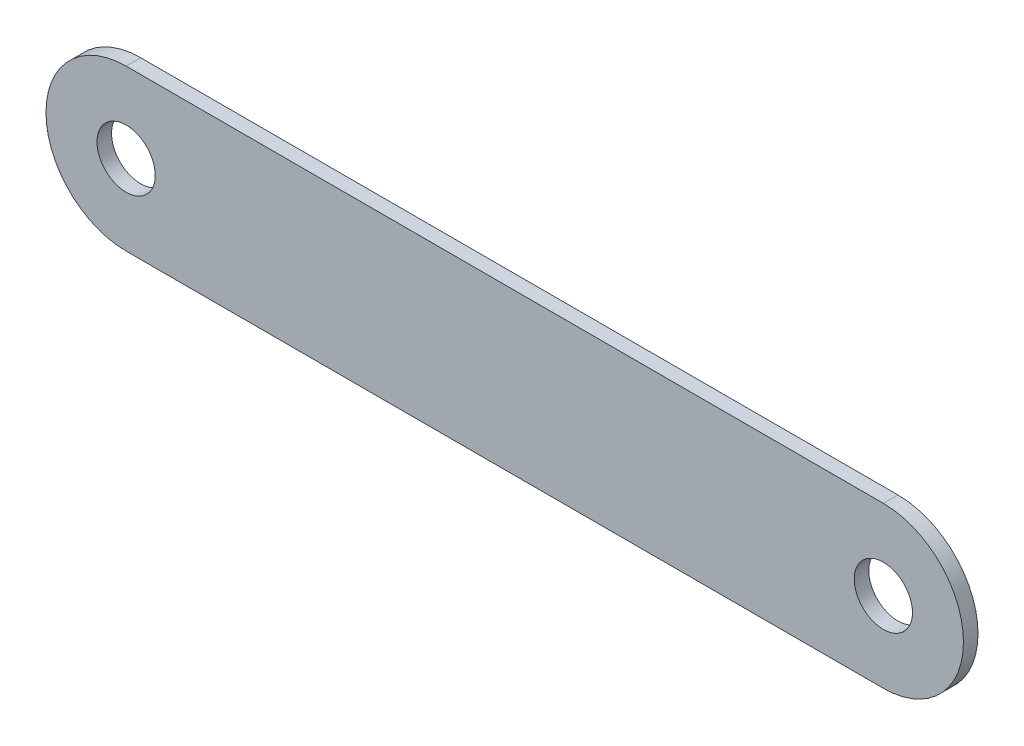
from build123d import *

# Parameters (mm, degrees)
ESQUISSE1_R      = 2
EXTRUSION1_DEPTH = 1


with BuildPart() as part:
    # Esquisse1 → Extrusion1 (new body)
    with BuildSketch(Plane.XY):
        with BuildLine():
            Line((0, 5.5), (52, 5.5))
            ThreePointArc((52, 5.5), (57.5, 0), (52, -5.5))
            Line((52, -5.5), (0, -5.5))
            ThreePointArc((0, -5.5), (-5.5, 0), (0, 5.5))
        make_face()
        with Locations((52, 0)):
            Circle(ESQUISSE1_R, mode=Mode.SUBTRACT)
        Circle(ESQUISSE1_R, mode=Mode.SUBTRACT)
    extrude(amount=EXTRUSION1_DEPTH)


solid = part.part
